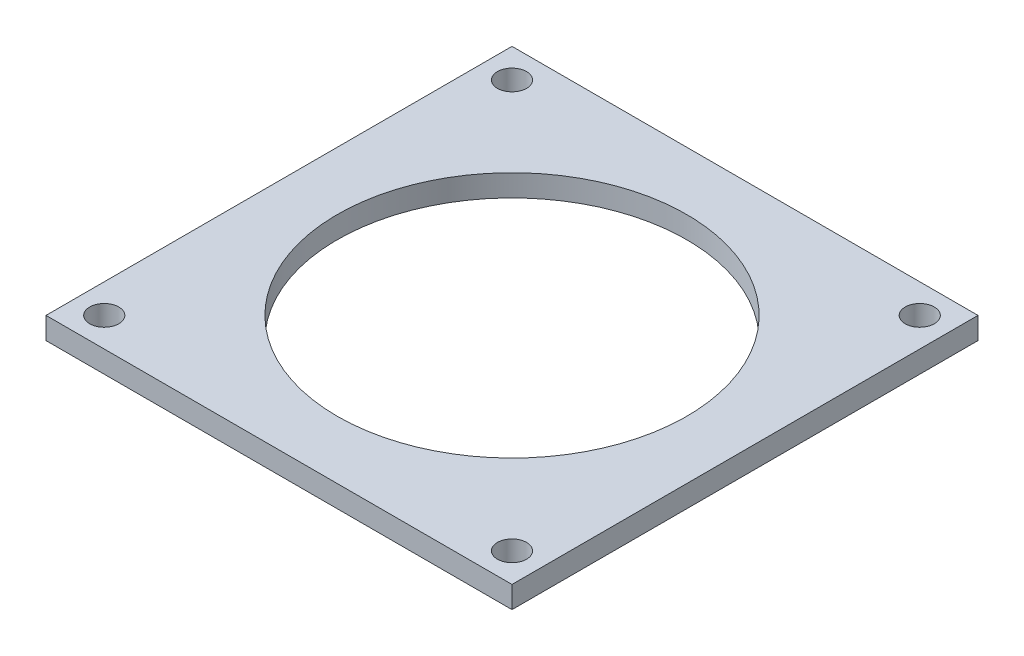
ISO-10303-21;
HEADER;
FILE_DESCRIPTION(('STEP AP214'),'2;1');
FILE_NAME('part.step','',(''),(''),'','','');
FILE_SCHEMA(('AUTOMOTIVE_DESIGN { 1 0 10303 214 1 1 1 1 }'));
ENDSEC;
DATA;
#1=APPLICATION_CONTEXT('core data for automotive mechanical design processes');
#2=APPLICATION_PROTOCOL_DEFINITION('international standard','automotive_design',2000,#1);
#3=PRODUCT_CONTEXT('',#1,'mechanical');
#4=PRODUCT('Part','Part','',(#3));
#5=PRODUCT_RELATED_PRODUCT_CATEGORY('part','',(#4));
#6=PRODUCT_DEFINITION_FORMATION('','',#4);
#7=PRODUCT_DEFINITION_CONTEXT('part definition',#1,'design');
#8=PRODUCT_DEFINITION('design','',#6,#7);
#9=PRODUCT_DEFINITION_SHAPE('','',#8);
#10=(LENGTH_UNIT() NAMED_UNIT(*) SI_UNIT(.MILLI.,.METRE.));
#11=(NAMED_UNIT(*) PLANE_ANGLE_UNIT() SI_UNIT($,.RADIAN.));
#12=(NAMED_UNIT(*) SI_UNIT($,.STERADIAN.) SOLID_ANGLE_UNIT());
#13=UNCERTAINTY_MEASURE_WITH_UNIT(LENGTH_MEASURE(1.E-05),#10,'distance_accuracy_value','');
#14=(GEOMETRIC_REPRESENTATION_CONTEXT(3) GLOBAL_UNCERTAINTY_ASSIGNED_CONTEXT((#13)) GLOBAL_UNIT_ASSIGNED_CONTEXT((#10,
#11,#12)) REPRESENTATION_CONTEXT('',''));
#15=CARTESIAN_POINT('',(0.,0.,0.));
#16=DIRECTION('',(0.,0.,1.));
#17=DIRECTION('',(1.,0.,0.));
#18=AXIS2_PLACEMENT_3D('',#15,#16,#17);
#19=CARTESIAN_POINT('',(-50.8,4.7625,-50.8));
#20=DIRECTION('',(1.,0.,0.));
#21=DIRECTION('',(0.,0.,-1.));
#22=AXIS2_PLACEMENT_3D('',#19,#20,#21);
#23=PLANE('',#22);
#24=DIRECTION('',(0.,0.,1.));
#25=VECTOR('',#24,1.);
#26=CARTESIAN_POINT('',(-50.8,0.,-50.8));
#27=LINE('',#26,#25);
#28=CARTESIAN_POINT('',(-50.8,0.,-50.8));
#29=VERTEX_POINT('',#28);
#30=CARTESIAN_POINT('',(-50.8,0.,50.8));
#31=VERTEX_POINT('',#30);
#32=EDGE_CURVE('E98',#29,#31,#27,.T.);
#33=ORIENTED_EDGE('',*,*,#32,.T.);
#34=DIRECTION('',(0.,-1.,0.));
#35=VECTOR('',#34,1.);
#36=CARTESIAN_POINT('',(-50.8,4.7625,50.8));
#37=LINE('',#36,#35);
#38=CARTESIAN_POINT('',(-50.8,4.7625,50.8));
#39=VERTEX_POINT('',#38);
#40=EDGE_CURVE('E11',#39,#31,#37,.T.);
#41=ORIENTED_EDGE('',*,*,#40,.F.);
#42=DIRECTION('',(0.,0.,1.));
#43=VECTOR('',#42,1.);
#44=CARTESIAN_POINT('',(-50.8,4.7625,-50.8));
#45=LINE('',#44,#43);
#46=CARTESIAN_POINT('',(-50.8,4.7625,-50.8));
#47=VERTEX_POINT('',#46);
#48=EDGE_CURVE('E86',#47,#39,#45,.T.);
#49=ORIENTED_EDGE('',*,*,#48,.F.);
#50=DIRECTION('',(0.,-1.,0.));
#51=VECTOR('',#50,1.);
#52=CARTESIAN_POINT('',(-50.8,4.7625,-50.8));
#53=LINE('',#52,#51);
#54=EDGE_CURVE('E94',#47,#29,#53,.T.);
#55=ORIENTED_EDGE('',*,*,#54,.T.);
#56=EDGE_LOOP('',(#33,#41,#49,#55));
#57=FACE_BOUND('',#56,.T.);
#58=ADVANCED_FACE('F35',(#57),#23,.F.);
#59=CARTESIAN_POINT('',(50.8,4.7625,50.8));
#60=DIRECTION('',(0.,0.,-1.));
#61=DIRECTION('',(-1.,0.,0.));
#62=AXIS2_PLACEMENT_3D('',#59,#60,#61);
#63=PLANE('',#62);
#64=DIRECTION('',(1.,0.,0.));
#65=VECTOR('',#64,1.);
#66=CARTESIAN_POINT('',(50.8,0.,50.8));
#67=LINE('',#66,#65);
#68=CARTESIAN_POINT('',(50.8,0.,50.8));
#69=VERTEX_POINT('',#68);
#70=EDGE_CURVE('E90',#31,#69,#67,.T.);
#71=ORIENTED_EDGE('',*,*,#70,.T.);
#72=DIRECTION('',(0.,-1.,0.));
#73=VECTOR('',#72,1.);
#74=CARTESIAN_POINT('',(50.8,4.7625,50.8));
#75=LINE('',#74,#73);
#76=CARTESIAN_POINT('',(50.8,4.7625,50.8));
#77=VERTEX_POINT('',#76);
#78=EDGE_CURVE('E43',#77,#69,#75,.T.);
#79=ORIENTED_EDGE('',*,*,#78,.F.);
#80=DIRECTION('',(1.,0.,0.));
#81=VECTOR('',#80,1.);
#82=CARTESIAN_POINT('',(50.8,4.7625,50.8));
#83=LINE('',#82,#81);
#84=EDGE_CURVE('E81',#39,#77,#83,.T.);
#85=ORIENTED_EDGE('',*,*,#84,.F.);
#86=ORIENTED_EDGE('',*,*,#40,.T.);
#87=EDGE_LOOP('',(#71,#79,#85,#86));
#88=FACE_BOUND('',#87,.T.);
#89=ADVANCED_FACE('F89',(#88),#63,.F.);
#90=CARTESIAN_POINT('',(50.8,4.7625,-50.8));
#91=DIRECTION('',(-1.,0.,0.));
#92=DIRECTION('',(0.,0.,1.));
#93=AXIS2_PLACEMENT_3D('',#90,#91,#92);
#94=PLANE('',#93);
#95=DIRECTION('',(0.,0.,-1.));
#96=VECTOR('',#95,1.);
#97=CARTESIAN_POINT('',(50.8,0.,-50.8));
#98=LINE('',#97,#96);
#99=CARTESIAN_POINT('',(50.8,0.,-50.8));
#100=VERTEX_POINT('',#99);
#101=EDGE_CURVE('E68',#69,#100,#98,.T.);
#102=ORIENTED_EDGE('',*,*,#101,.T.);
#103=DIRECTION('',(0.,-1.,0.));
#104=VECTOR('',#103,1.);
#105=CARTESIAN_POINT('',(50.8,4.7625,-50.8));
#106=LINE('',#105,#104);
#107=CARTESIAN_POINT('',(50.8,4.7625,-50.8));
#108=VERTEX_POINT('',#107);
#109=EDGE_CURVE('E91',#108,#100,#106,.T.);
#110=ORIENTED_EDGE('',*,*,#109,.F.);
#111=DIRECTION('',(0.,0.,-1.));
#112=VECTOR('',#111,1.);
#113=CARTESIAN_POINT('',(50.8,4.7625,-50.8));
#114=LINE('',#113,#112);
#115=EDGE_CURVE('E84',#77,#108,#114,.T.);
#116=ORIENTED_EDGE('',*,*,#115,.F.);
#117=ORIENTED_EDGE('',*,*,#78,.T.);
#118=EDGE_LOOP('',(#102,#110,#116,#117));
#119=FACE_BOUND('',#118,.T.);
#120=ADVANCED_FACE('F92',(#119),#94,.F.);
#121=CARTESIAN_POINT('',(50.8,4.7625,-50.8));
#122=DIRECTION('',(0.,0.,1.));
#123=DIRECTION('',(1.,0.,0.));
#124=AXIS2_PLACEMENT_3D('',#121,#122,#123);
#125=PLANE('',#124);
#126=DIRECTION('',(-1.,0.,0.));
#127=VECTOR('',#126,1.);
#128=CARTESIAN_POINT('',(50.8,0.,-50.8));
#129=LINE('',#128,#127);
#130=EDGE_CURVE('E74',#100,#29,#129,.T.);
#131=ORIENTED_EDGE('',*,*,#130,.T.);
#132=ORIENTED_EDGE('',*,*,#54,.F.);
#133=DIRECTION('',(-1.,0.,0.));
#134=VECTOR('',#133,1.);
#135=CARTESIAN_POINT('',(50.8,4.7625,-50.8));
#136=LINE('',#135,#134);
#137=EDGE_CURVE('E51',#108,#47,#136,.T.);
#138=ORIENTED_EDGE('',*,*,#137,.F.);
#139=ORIENTED_EDGE('',*,*,#109,.T.);
#140=EDGE_LOOP('',(#131,#132,#138,#139));
#141=FACE_BOUND('',#140,.T.);
#142=ADVANCED_FACE('F106',(#141),#125,.F.);
#143=CARTESIAN_POINT('',(0.,4.7625,0.));
#144=DIRECTION('',(0.,-1.,0.));
#145=DIRECTION('',(0.,0.,-1.));
#146=AXIS2_PLACEMENT_3D('',#143,#144,#145);
#147=PLANE('',#146);
#148=CARTESIAN_POINT('',(-44.4499999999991,4.7625,44.45));
#149=DIRECTION('',(0.,1.,0.));
#150=DIRECTION('',(0.,0.,1.));
#151=AXIS2_PLACEMENT_3D('',#148,#149,#150);
#152=CIRCLE('',#151,3.175);
#153=CARTESIAN_POINT('',(-44.4499999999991,4.7625,47.625));
#154=VERTEX_POINT('',#153);
#155=EDGE_CURVE('E118',#154,#154,#152,.T.);
#156=ORIENTED_EDGE('',*,*,#155,.F.);
#157=EDGE_LOOP('',(#156));
#158=FACE_BOUND('',#157,.T.);
#159=CARTESIAN_POINT('',(44.4500000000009,4.7625,44.45));
#160=DIRECTION('',(0.,1.,0.));
#161=DIRECTION('',(0.,0.,1.));
#162=AXIS2_PLACEMENT_3D('',#159,#160,#161);
#163=CIRCLE('',#162,3.175);
#164=CARTESIAN_POINT('',(44.4500000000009,4.7625,47.625));
#165=VERTEX_POINT('',#164);
#166=EDGE_CURVE('E124',#165,#165,#163,.T.);
#167=ORIENTED_EDGE('',*,*,#166,.F.);
#168=EDGE_LOOP('',(#167));
#169=FACE_BOUND('',#168,.T.);
#170=CARTESIAN_POINT('',(44.45,4.7625,-44.45));
#171=DIRECTION('',(0.,1.,0.));
#172=DIRECTION('',(0.,0.,1.));
#173=AXIS2_PLACEMENT_3D('',#170,#171,#172);
#174=CIRCLE('',#173,3.175);
#175=CARTESIAN_POINT('',(44.45,4.7625,-41.275));
#176=VERTEX_POINT('',#175);
#177=EDGE_CURVE('E130',#176,#176,#174,.T.);
#178=ORIENTED_EDGE('',*,*,#177,.F.);
#179=EDGE_LOOP('',(#178));
#180=FACE_BOUND('',#179,.T.);
#181=CARTESIAN_POINT('',(0.,4.7625,0.));
#182=DIRECTION('',(0.,1.,0.));
#183=DIRECTION('',(0.,0.,1.));
#184=AXIS2_PLACEMENT_3D('',#181,#182,#183);
#185=CIRCLE('',#184,38.1);
#186=CARTESIAN_POINT('',(0.,4.7625,38.1));
#187=VERTEX_POINT('',#186);
#188=EDGE_CURVE('E136',#187,#187,#185,.T.);
#189=ORIENTED_EDGE('',*,*,#188,.F.);
#190=EDGE_LOOP('',(#189));
#191=FACE_BOUND('',#190,.T.);
#192=CARTESIAN_POINT('',(-44.45,4.7625,-44.45));
#193=DIRECTION('',(0.,1.,0.));
#194=DIRECTION('',(0.,0.,1.));
#195=AXIS2_PLACEMENT_3D('',#192,#193,#194);
#196=CIRCLE('',#195,3.175);
#197=CARTESIAN_POINT('',(-44.45,4.7625,-41.275));
#198=VERTEX_POINT('',#197);
#199=EDGE_CURVE('E112',#198,#198,#196,.T.);
#200=ORIENTED_EDGE('',*,*,#199,.F.);
#201=EDGE_LOOP('',(#200));
#202=FACE_BOUND('',#201,.T.);
#203=ORIENTED_EDGE('',*,*,#48,.T.);
#204=ORIENTED_EDGE('',*,*,#84,.T.);
#205=ORIENTED_EDGE('',*,*,#115,.T.);
#206=ORIENTED_EDGE('',*,*,#137,.T.);
#207=EDGE_LOOP('',(#203,#204,#205,#206));
#208=FACE_BOUND('',#207,.T.);
#209=ADVANCED_FACE('F82',(#158,#169,#180,#191,#202,#208),#147,.F.);
#210=CARTESIAN_POINT('',(0.,0.,0.));
#211=DIRECTION('',(0.,-1.,0.));
#212=DIRECTION('',(0.,0.,-1.));
#213=AXIS2_PLACEMENT_3D('',#210,#211,#212);
#214=PLANE('',#213);
#215=CARTESIAN_POINT('',(-44.4499999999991,0.,44.45));
#216=DIRECTION('',(0.,1.,0.));
#217=DIRECTION('',(0.,0.,1.));
#218=AXIS2_PLACEMENT_3D('',#215,#216,#217);
#219=CIRCLE('',#218,3.175);
#220=CARTESIAN_POINT('',(-44.4499999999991,0.,47.625));
#221=VERTEX_POINT('',#220);
#222=EDGE_CURVE('E121',#221,#221,#219,.T.);
#223=ORIENTED_EDGE('',*,*,#222,.T.);
#224=EDGE_LOOP('',(#223));
#225=FACE_BOUND('',#224,.T.);
#226=CARTESIAN_POINT('',(44.4500000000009,0.,44.45));
#227=DIRECTION('',(0.,1.,0.));
#228=DIRECTION('',(0.,0.,1.));
#229=AXIS2_PLACEMENT_3D('',#226,#227,#228);
#230=CIRCLE('',#229,3.175);
#231=CARTESIAN_POINT('',(44.4500000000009,0.,47.625));
#232=VERTEX_POINT('',#231);
#233=EDGE_CURVE('E127',#232,#232,#230,.T.);
#234=ORIENTED_EDGE('',*,*,#233,.T.);
#235=EDGE_LOOP('',(#234));
#236=FACE_BOUND('',#235,.T.);
#237=CARTESIAN_POINT('',(44.45,0.,-44.45));
#238=DIRECTION('',(0.,1.,0.));
#239=DIRECTION('',(0.,0.,1.));
#240=AXIS2_PLACEMENT_3D('',#237,#238,#239);
#241=CIRCLE('',#240,3.175);
#242=CARTESIAN_POINT('',(44.45,0.,-41.275));
#243=VERTEX_POINT('',#242);
#244=EDGE_CURVE('E133',#243,#243,#241,.T.);
#245=ORIENTED_EDGE('',*,*,#244,.T.);
#246=EDGE_LOOP('',(#245));
#247=FACE_BOUND('',#246,.T.);
#248=CARTESIAN_POINT('',(0.,0.,0.));
#249=DIRECTION('',(0.,1.,0.));
#250=DIRECTION('',(0.,0.,1.));
#251=AXIS2_PLACEMENT_3D('',#248,#249,#250);
#252=CIRCLE('',#251,38.1);
#253=CARTESIAN_POINT('',(0.,0.,38.1));
#254=VERTEX_POINT('',#253);
#255=EDGE_CURVE('E115',#254,#254,#252,.T.);
#256=ORIENTED_EDGE('',*,*,#255,.T.);
#257=EDGE_LOOP('',(#256));
#258=FACE_BOUND('',#257,.T.);
#259=CARTESIAN_POINT('',(-44.45,0.,-44.45));
#260=DIRECTION('',(0.,1.,0.));
#261=DIRECTION('',(0.,0.,1.));
#262=AXIS2_PLACEMENT_3D('',#259,#260,#261);
#263=CIRCLE('',#262,3.175);
#264=CARTESIAN_POINT('',(-44.45,0.,-41.275));
#265=VERTEX_POINT('',#264);
#266=EDGE_CURVE('E101',#265,#265,#263,.T.);
#267=ORIENTED_EDGE('',*,*,#266,.T.);
#268=EDGE_LOOP('',(#267));
#269=FACE_BOUND('',#268,.T.);
#270=ORIENTED_EDGE('',*,*,#32,.F.);
#271=ORIENTED_EDGE('',*,*,#130,.F.);
#272=ORIENTED_EDGE('',*,*,#101,.F.);
#273=ORIENTED_EDGE('',*,*,#70,.F.);
#274=EDGE_LOOP('',(#270,#271,#272,#273));
#275=FACE_BOUND('',#274,.T.);
#276=ADVANCED_FACE('F109',(#225,#236,#247,#258,#269,#275),#214,.T.);
#277=CARTESIAN_POINT('',(-44.45,0.,-44.45));
#278=DIRECTION('',(0.,1.,0.));
#279=DIRECTION('',(0.,0.,1.));
#280=AXIS2_PLACEMENT_3D('',#277,#278,#279);
#281=CYLINDRICAL_SURFACE('',#280,3.175);
#282=ORIENTED_EDGE('',*,*,#266,.F.);
#283=EDGE_LOOP('',(#282));
#284=FACE_BOUND('',#283,.T.);
#285=ORIENTED_EDGE('',*,*,#199,.T.);
#286=EDGE_LOOP('',(#285));
#287=FACE_BOUND('',#286,.T.);
#288=ADVANCED_FACE('F148',(#284,#287),#281,.F.);
#289=CARTESIAN_POINT('',(0.,0.,0.));
#290=DIRECTION('',(0.,1.,0.));
#291=DIRECTION('',(0.,0.,1.));
#292=AXIS2_PLACEMENT_3D('',#289,#290,#291);
#293=CYLINDRICAL_SURFACE('',#292,38.1);
#294=ORIENTED_EDGE('',*,*,#255,.F.);
#295=EDGE_LOOP('',(#294));
#296=FACE_BOUND('',#295,.T.);
#297=ORIENTED_EDGE('',*,*,#188,.T.);
#298=EDGE_LOOP('',(#297));
#299=FACE_BOUND('',#298,.T.);
#300=ADVANCED_FACE('F144',(#296,#299),#293,.F.);
#301=CARTESIAN_POINT('',(44.45,0.,-44.45));
#302=DIRECTION('',(0.,1.,0.));
#303=DIRECTION('',(0.,0.,1.));
#304=AXIS2_PLACEMENT_3D('',#301,#302,#303);
#305=CYLINDRICAL_SURFACE('',#304,3.175);
#306=ORIENTED_EDGE('',*,*,#244,.F.);
#307=EDGE_LOOP('',(#306));
#308=FACE_BOUND('',#307,.T.);
#309=ORIENTED_EDGE('',*,*,#177,.T.);
#310=EDGE_LOOP('',(#309));
#311=FACE_BOUND('',#310,.T.);
#312=ADVANCED_FACE('F147',(#308,#311),#305,.F.);
#313=CARTESIAN_POINT('',(44.4500000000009,0.,44.45));
#314=DIRECTION('',(0.,1.,0.));
#315=DIRECTION('',(0.,0.,1.));
#316=AXIS2_PLACEMENT_3D('',#313,#314,#315);
#317=CYLINDRICAL_SURFACE('',#316,3.175);
#318=ORIENTED_EDGE('',*,*,#233,.F.);
#319=EDGE_LOOP('',(#318));
#320=FACE_BOUND('',#319,.T.);
#321=ORIENTED_EDGE('',*,*,#166,.T.);
#322=EDGE_LOOP('',(#321));
#323=FACE_BOUND('',#322,.T.);
#324=ADVANCED_FACE('F209',(#320,#323),#317,.F.);
#325=CARTESIAN_POINT('',(-44.4499999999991,0.,44.45));
#326=DIRECTION('',(0.,1.,0.));
#327=DIRECTION('',(0.,0.,1.));
#328=AXIS2_PLACEMENT_3D('',#325,#326,#327);
#329=CYLINDRICAL_SURFACE('',#328,3.175);
#330=ORIENTED_EDGE('',*,*,#222,.F.);
#331=EDGE_LOOP('',(#330));
#332=FACE_BOUND('',#331,.T.);
#333=ORIENTED_EDGE('',*,*,#155,.T.);
#334=EDGE_LOOP('',(#333));
#335=FACE_BOUND('',#334,.T.);
#336=ADVANCED_FACE('F219',(#332,#335),#329,.F.);
#337=CLOSED_SHELL('',(#58,#89,#120,#142,#209,#276,#288,#300,#312,#324,#336));
#338=MANIFOLD_SOLID_BREP('B2',#337);
#339=ADVANCED_BREP_SHAPE_REPRESENTATION('',(#18,#338),#14);
#340=SHAPE_DEFINITION_REPRESENTATION(#9,#339);
ENDSEC;
END-ISO-10303-21;
